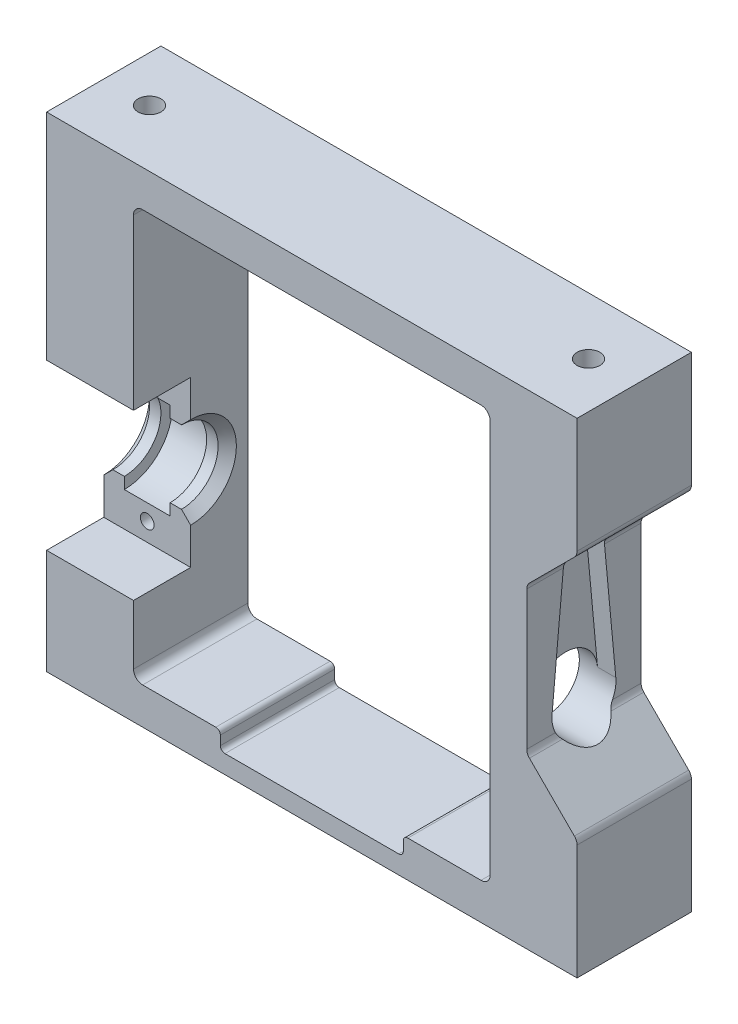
from build123d import *

# Parameters (mm, degrees)
SKETCH_1_W                  = 58
SKETCH_1_H                  = 53
EXTRUDE_452_DEPTH           = 12.5
SKETCH_3_W                  = 39
SKETCH_3_H                  = 45
CUT_EXTRUDE_614_DEPTH       = 42.22499242
SKETCH_11_R                 = 1.25
CUT_EXTRUDE_818_DEPTH       = 10
SKETCH_4_R                  = 3.5
CUT_EXTRUDE_1040_DEPTH      = 65.980766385
CUT_EXTRUDE_1251_DEPTH      = 7.5
SKETCH_6_R                  = 4
CUT_EXTRUDE_1412_DEPTH      = 9.5
SKETCH_7_W                  = 6.25
SKETCH_7_H                  = 18
CUT_EXTRUDE_1602_DEPTH      = 9.5
CUT_EXTRUDE_1779_DEPTH      = 2.5
CUT_EXTRUDE_1779_DEPTH_BACK = 2.5
SKETCH_8_R                  = 5.25
SKETCH_9_R                  = 0.75
CUT_EXTRUDE_2053_DEPTH      = 40.778291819
CUT_EXTRUDE_2343_DEPTH      = 42.22499242
CHAMFER_1_SIZE              = 1
FILLET_1_R                  = 1
SKETCH_12_W                 = 20
SKETCH_12_H                 = 2
CUT_EXTRUDE_3057_DEPTH      = 42.22499245
FILLET_2_R                  = 0.5


with BuildPart() as part:
    # Sketch 1 → Extrude 452 (new body)
    with BuildSketch(Plane.XY):
        Rectangle(SKETCH_1_W, SKETCH_1_H)
    extrude(amount=EXTRUDE_452_DEPTH)

    # Sketch 3 → Cut-Extrude 614 (cut, through all)
    with BuildSketch(Plane.XY.offset(12.5)):
        Rectangle(SKETCH_3_W, SKETCH_3_H)
    extrude(amount=-CUT_EXTRUDE_614_DEPTH, mode=Mode.SUBTRACT)

    # Sketch 11 → Cut-Extrude 818 (cut)
    with BuildSketch(Plane.XZ.offset(26.5)):
        with Locations(Location((-24, 6.25, 0), (0, 0, 270))):
            Circle(SKETCH_11_R)
        with Locations(Location((24, 6.25, 0), (0, 0, 270))):
            Circle(SKETCH_11_R)
    cut_extrude_818 = extrude(amount=-CUT_EXTRUDE_818_DEPTH, mode=Mode.SUBTRACT)

    # Mirror 862: Cut-Extrude 818 across plane
    add(cut_extrude_818.mirror(Plane.ZX), mode=Mode.SUBTRACT)

    # Sketch 4 → Cut-Extrude 1040 (cut, through all)
    with BuildSketch(Plane(origin=(29, 0, 0), x_dir=(0, 0, -1), z_dir=(1, 0, 0))):
        with Locations((-6.25, -6)):
            Circle(SKETCH_4_R)
    extrude(amount=-CUT_EXTRUDE_1040_DEPTH, mode=Mode.SUBTRACT)

    # Sketch 5 → Cut-Extrude 1251 (cut)
    with BuildSketch(Plane(origin=(29, 0, 0), x_dir=(0, 0, -1), z_dir=(1, 0, 0))):
        with BuildLine():
            Line((-9.734878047, -5.675), (-8.440494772, 8.204285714))
            ThreePointArc((-8.440494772, 8.204285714), (-6.25, 10.2), (-4.059505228, 8.204285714))
            Line((-4.059505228, 8.204285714), (-2.765121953, -5.675))
            ThreePointArc((-2.765121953, -5.675), (-6.25, -9.5), (-9.734878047, -5.675))
        make_face()
    extrude(amount=-CUT_EXTRUDE_1251_DEPTH, mode=Mode.SUBTRACT)

    # Sketch 6 → Cut-Extrude 1412 (cut)
    with BuildSketch(Plane.ZY.offset(29)):
        with Locations((6.25, -6)):
            Circle(SKETCH_6_R)
    extrude(amount=-CUT_EXTRUDE_1412_DEPTH, mode=Mode.SUBTRACT)

    # Sketch 7 → Cut-Extrude 1602 (cut)
    with BuildSketch(Plane.ZY.offset(29)):
        with Locations((9.375, -6)):
            Rectangle(SKETCH_7_W, SKETCH_7_H)
    extrude(amount=-CUT_EXTRUDE_1602_DEPTH, mode=Mode.SUBTRACT)

    # Sketch 8 → Cut-Extrude 1779 (cut, two sides: drawn at the far end of the back side and taken through both)
    with BuildSketch(Plane.ZY.offset(24.25).offset(-CUT_EXTRUDE_1779_DEPTH_BACK)):
        with Locations((6.25, -6)):
            Circle(SKETCH_8_R)
    extrude(amount=CUT_EXTRUDE_1779_DEPTH + CUT_EXTRUDE_1779_DEPTH_BACK, mode=Mode.SUBTRACT)

    # Sketch 9 → Cut-Extrude 2053 (cut, through all)
    with BuildSketch(Plane.XY.offset(6.25)):
        with Locations((-24.25, 1)):
            Circle(SKETCH_9_R)
        with Locations((-24.25, -13)):
            Circle(SKETCH_9_R)
    extrude(amount=-CUT_EXTRUDE_2053_DEPTH, mode=Mode.SUBTRACT)

    # Sketch 10 → Cut-Extrude 2343 (cut, through all)
    with BuildSketch(Plane.XY.offset(12.5)):
        Polygon((29, -13.5), (29, 13.5), (23.5, 8), (23.5, -8), align=None)
    extrude(amount=-CUT_EXTRUDE_2343_DEPTH, mode=Mode.SUBTRACT)

    # Chamfer 1
    chamfer_1_edges = [part.edges().sort_by_distance(p)[0] for p in [
        (-29, -6, 2.25),
        (-19.5, -6, 2.25),
    ]]
    chamfer(chamfer_1_edges, length=CHAMFER_1_SIZE)

    # Fillet 1
    fillet_1_edges = [part.edges().sort_by_distance(p)[0] for p in [
        (29, -13.5, 6.25),
        (23.5, -8, 10.811140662),
        (23.5, -8, 1.688859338),
        (23.5, 8, 10.479773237),
        (23.5, 8, 2.020226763),
        (29, 13.5, 6.25),
        (19.5, -22.5, 6.25),
        (-19.5, -22.5, 6.25),
        (-19.5, 22.5, 6.25),
        (19.5, 22.5, 6.25),
    ]]
    fillet(fillet_1_edges, radius=FILLET_1_R)

    # Sketch 12 → Cut-Extrude 3057 (cut, through all)
    with BuildSketch(Plane.XY):
        with Locations((0, -23.5)):
            Rectangle(SKETCH_12_W, SKETCH_12_H)
    extrude(amount=CUT_EXTRUDE_3057_DEPTH, mode=Mode.SUBTRACT)

    # Fillet 2
    fillet_2_edges = [part.edges().sort_by_distance(p)[0] for p in [
        (-10, -22.5, 6.25),
        (-10, -24.5, 6.25),
        (10, -24.5, 6.25),
        (10, -22.5, 6.25),
    ]]
    fillet(fillet_2_edges, radius=FILLET_2_R)


solid = part.part
